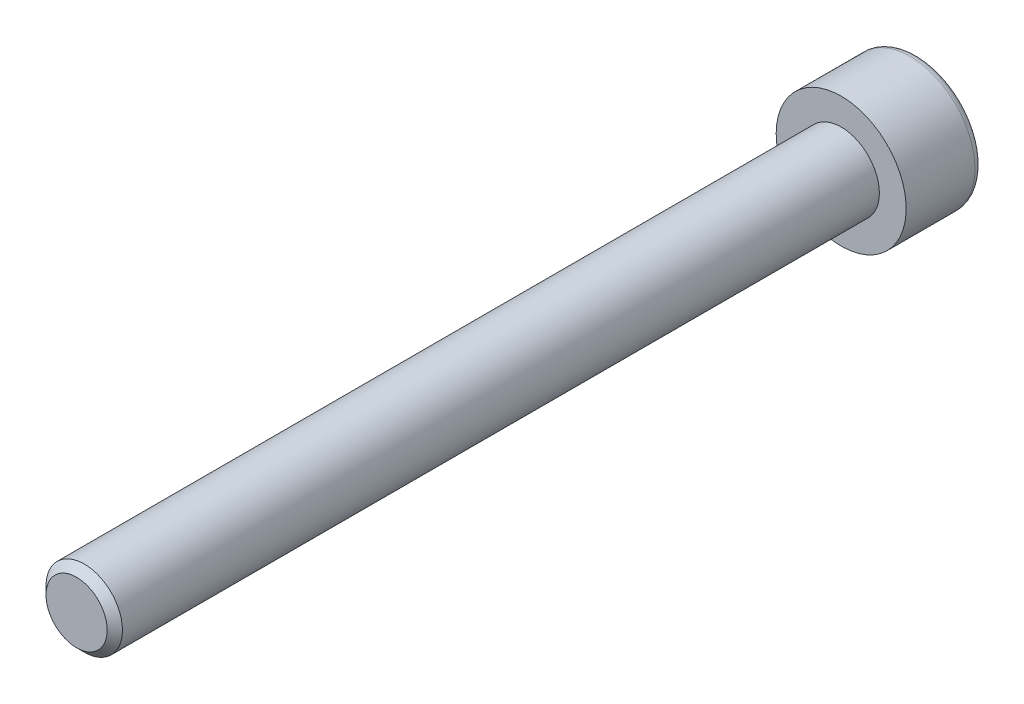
ISO-10303-21;
HEADER;
FILE_DESCRIPTION(('STEP AP214'),'2;1');
FILE_NAME('part.step','',(''),(''),'','','');
FILE_SCHEMA(('AUTOMOTIVE_DESIGN { 1 0 10303 214 1 1 1 1 }'));
ENDSEC;
DATA;
#1=APPLICATION_CONTEXT('core data for automotive mechanical design processes');
#2=APPLICATION_PROTOCOL_DEFINITION('international standard','automotive_design',2000,#1);
#3=PRODUCT_CONTEXT('',#1,'mechanical');
#4=PRODUCT('Part','Part','',(#3));
#5=PRODUCT_RELATED_PRODUCT_CATEGORY('part','',(#4));
#6=PRODUCT_DEFINITION_FORMATION('','',#4);
#7=PRODUCT_DEFINITION_CONTEXT('part definition',#1,'design');
#8=PRODUCT_DEFINITION('design','',#6,#7);
#9=PRODUCT_DEFINITION_SHAPE('','',#8);
#10=(LENGTH_UNIT() NAMED_UNIT(*) SI_UNIT(.MILLI.,.METRE.));
#11=(NAMED_UNIT(*) PLANE_ANGLE_UNIT() SI_UNIT($,.RADIAN.));
#12=(NAMED_UNIT(*) SI_UNIT($,.STERADIAN.) SOLID_ANGLE_UNIT());
#13=UNCERTAINTY_MEASURE_WITH_UNIT(LENGTH_MEASURE(1.E-05),#10,'distance_accuracy_value','');
#14=(GEOMETRIC_REPRESENTATION_CONTEXT(3) GLOBAL_UNCERTAINTY_ASSIGNED_CONTEXT((#13)) GLOBAL_UNIT_ASSIGNED_CONTEXT((#10,
#11,#12)) REPRESENTATION_CONTEXT('',''));
#15=CARTESIAN_POINT('',(0.,0.,0.));
#16=DIRECTION('',(0.,0.,1.));
#17=DIRECTION('',(1.,0.,0.));
#18=AXIS2_PLACEMENT_3D('',#15,#16,#17);
#19=CARTESIAN_POINT('',(0.,0.,-5.));
#20=DIRECTION('',(0.,0.,1.));
#21=DIRECTION('',(1.,0.,0.));
#22=AXIS2_PLACEMENT_3D('',#19,#20,#21);
#23=PLANE('',#22);
#24=CARTESIAN_POINT('',(0.,0.,-5.));
#25=DIRECTION('',(0.,0.,-1.));
#26=DIRECTION('',(-1.,0.,0.));
#27=AXIS2_PLACEMENT_3D('',#24,#25,#26);
#28=CIRCLE('',#27,3.75);
#29=CARTESIAN_POINT('',(-3.75,0.,-5.));
#30=VERTEX_POINT('',#29);
#31=EDGE_CURVE('E138',#30,#30,#28,.T.);
#32=ORIENTED_EDGE('',*,*,#31,.T.);
#33=EDGE_LOOP('',(#32));
#34=FACE_BOUND('',#33,.T.);
#35=DIRECTION('',(-0.86602540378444,0.499999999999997,0.));
#36=VECTOR('',#35,1.);
#37=CARTESIAN_POINT('',(0.,2.3094010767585,-5.));
#38=LINE('',#37,#36);
#39=CARTESIAN_POINT('',(2.,1.15470053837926,-5.));
#40=VERTEX_POINT('',#39);
#41=CARTESIAN_POINT('',(0.,2.3094010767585,-5.));
#42=VERTEX_POINT('',#41);
#43=EDGE_CURVE('E42',#40,#42,#38,.T.);
#44=ORIENTED_EDGE('',*,*,#43,.T.);
#45=DIRECTION('',(-0.866025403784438,-0.500000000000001,0.));
#46=VECTOR('',#45,1.);
#47=CARTESIAN_POINT('',(0.,2.3094010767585,-5.));
#48=LINE('',#47,#46);
#49=CARTESIAN_POINT('',(-2.,1.15470053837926,-5.));
#50=VERTEX_POINT('',#49);
#51=EDGE_CURVE('E82',#42,#50,#48,.T.);
#52=ORIENTED_EDGE('',*,*,#51,.T.);
#53=DIRECTION('',(0.,-1.,0.));
#54=VECTOR('',#53,1.);
#55=CARTESIAN_POINT('',(-2.,-1.15470053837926,-5.));
#56=LINE('',#55,#54);
#57=CARTESIAN_POINT('',(-2.,-1.15470053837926,-5.));
#58=VERTEX_POINT('',#57);
#59=EDGE_CURVE('E90',#50,#58,#56,.T.);
#60=ORIENTED_EDGE('',*,*,#59,.T.);
#61=DIRECTION('',(0.866025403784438,-0.500000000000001,0.));
#62=VECTOR('',#61,1.);
#63=CARTESIAN_POINT('',(0.,-2.3094010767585,-5.));
#64=LINE('',#63,#62);
#65=CARTESIAN_POINT('',(0.,-2.3094010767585,-5.));
#66=VERTEX_POINT('',#65);
#67=EDGE_CURVE('E108',#58,#66,#64,.T.);
#68=ORIENTED_EDGE('',*,*,#67,.T.);
#69=DIRECTION('',(0.86602540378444,0.499999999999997,0.));
#70=VECTOR('',#69,1.);
#71=CARTESIAN_POINT('',(0.,-2.3094010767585,-5.));
#72=LINE('',#71,#70);
#73=CARTESIAN_POINT('',(2.,-1.15470053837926,-5.));
#74=VERTEX_POINT('',#73);
#75=EDGE_CURVE('E111',#66,#74,#72,.T.);
#76=ORIENTED_EDGE('',*,*,#75,.T.);
#77=DIRECTION('',(0.,1.,0.));
#78=VECTOR('',#77,1.);
#79=CARTESIAN_POINT('',(2.,-1.15470053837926,-5.));
#80=LINE('',#79,#78);
#81=EDGE_CURVE('E101',#74,#40,#80,.T.);
#82=ORIENTED_EDGE('',*,*,#81,.T.);
#83=EDGE_LOOP('',(#44,#52,#60,#68,#76,#82));
#84=FACE_BOUND('',#83,.T.);
#85=ADVANCED_FACE('F28',(#34,#84),#23,.F.);
#86=CARTESIAN_POINT('',(0.,0.,-4.5));
#87=DIRECTION('',(0.,0.,-1.));
#88=DIRECTION('',(-1.,0.,0.));
#89=AXIS2_PLACEMENT_3D('',#86,#87,#88);
#90=TOROIDAL_SURFACE('',#89,3.75,0.5);
#91=ORIENTED_EDGE('',*,*,#31,.F.);
#92=EDGE_LOOP('',(#91));
#93=FACE_BOUND('',#92,.T.);
#94=CARTESIAN_POINT('',(0.,0.,-4.5));
#95=DIRECTION('',(0.,0.,-1.));
#96=DIRECTION('',(-1.,0.,0.));
#97=AXIS2_PLACEMENT_3D('',#94,#95,#96);
#98=CIRCLE('',#97,4.25);
#99=CARTESIAN_POINT('',(-4.25,0.,-4.5));
#100=VERTEX_POINT('',#99);
#101=EDGE_CURVE('E135',#100,#100,#98,.T.);
#102=ORIENTED_EDGE('',*,*,#101,.T.);
#103=EDGE_LOOP('',(#102));
#104=FACE_BOUND('',#103,.T.);
#105=ADVANCED_FACE('F157',(#93,#104),#90,.T.);
#106=CARTESIAN_POINT('',(0.,0.,0.));
#107=DIRECTION('',(0.,0.,-1.));
#108=DIRECTION('',(-1.,0.,0.));
#109=AXIS2_PLACEMENT_3D('',#106,#107,#108);
#110=CYLINDRICAL_SURFACE('',#109,4.25);
#111=ORIENTED_EDGE('',*,*,#101,.F.);
#112=EDGE_LOOP('',(#111));
#113=FACE_BOUND('',#112,.T.);
#114=CARTESIAN_POINT('',(0.,0.,0.));
#115=DIRECTION('',(0.,0.,-1.));
#116=DIRECTION('',(-1.,0.,0.));
#117=AXIS2_PLACEMENT_3D('',#114,#115,#116);
#118=CIRCLE('',#117,4.25);
#119=CARTESIAN_POINT('',(-4.25,0.,0.));
#120=VERTEX_POINT('',#119);
#121=EDGE_CURVE('E96',#120,#120,#118,.T.);
#122=ORIENTED_EDGE('',*,*,#121,.T.);
#123=EDGE_LOOP('',(#122));
#124=FACE_BOUND('',#123,.T.);
#125=ADVANCED_FACE('F162',(#113,#124),#110,.T.);
#126=CARTESIAN_POINT('',(0.,0.,0.));
#127=DIRECTION('',(0.,0.,-1.));
#128=DIRECTION('',(-1.,0.,0.));
#129=AXIS2_PLACEMENT_3D('',#126,#127,#128);
#130=PLANE('',#129);
#131=CARTESIAN_POINT('',(0.,0.,0.));
#132=DIRECTION('',(0.,0.,1.));
#133=DIRECTION('',(1.,0.,0.));
#134=AXIS2_PLACEMENT_3D('',#131,#132,#133);
#135=CIRCLE('',#134,2.5);
#136=CARTESIAN_POINT('',(2.5,0.,0.));
#137=VERTEX_POINT('',#136);
#138=EDGE_CURVE('E102',#137,#137,#135,.T.);
#139=ORIENTED_EDGE('',*,*,#138,.F.);
#140=EDGE_LOOP('',(#139));
#141=FACE_BOUND('',#140,.T.);
#142=ORIENTED_EDGE('',*,*,#121,.F.);
#143=EDGE_LOOP('',(#142));
#144=FACE_BOUND('',#143,.T.);
#145=ADVANCED_FACE('F170',(#141,#144),#130,.F.);
#146=CARTESIAN_POINT('',(0.,2.3094010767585,-2.5));
#147=DIRECTION('',(-0.499999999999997,-0.86602540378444,0.));
#148=DIRECTION('',(0.86602540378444,-0.499999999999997,0.));
#149=AXIS2_PLACEMENT_3D('',#146,#147,#148);
#150=PLANE('',#149);
#151=ORIENTED_EDGE('',*,*,#43,.F.);
#152=DIRECTION('',(0.,0.,-1.));
#153=VECTOR('',#152,1.);
#154=CARTESIAN_POINT('',(2.,1.15470053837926,-2.5));
#155=LINE('',#154,#153);
#156=CARTESIAN_POINT('',(2.,1.15470053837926,-2.5));
#157=VERTEX_POINT('',#156);
#158=EDGE_CURVE('E124',#157,#40,#155,.T.);
#159=ORIENTED_EDGE('',*,*,#158,.F.);
#160=DIRECTION('',(-0.86602540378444,0.499999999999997,0.));
#161=VECTOR('',#160,1.);
#162=CARTESIAN_POINT('',(0.,2.3094010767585,-2.5));
#163=LINE('',#162,#161);
#164=CARTESIAN_POINT('',(0.,2.3094010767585,-2.5));
#165=VERTEX_POINT('',#164);
#166=EDGE_CURVE('E95',#157,#165,#163,.T.);
#167=ORIENTED_EDGE('',*,*,#166,.T.);
#168=DIRECTION('',(0.,0.,-1.));
#169=VECTOR('',#168,1.);
#170=CARTESIAN_POINT('',(0.,2.3094010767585,-2.5));
#171=LINE('',#170,#169);
#172=EDGE_CURVE('E84',#165,#42,#171,.T.);
#173=ORIENTED_EDGE('',*,*,#172,.T.);
#174=EDGE_LOOP('',(#151,#159,#167,#173));
#175=FACE_BOUND('',#174,.T.);
#176=ADVANCED_FACE('F93',(#175),#150,.T.);
#177=CARTESIAN_POINT('',(0.,2.3094010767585,-2.5));
#178=DIRECTION('',(0.500000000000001,-0.866025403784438,0.));
#179=DIRECTION('',(0.866025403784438,0.500000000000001,0.));
#180=AXIS2_PLACEMENT_3D('',#177,#178,#179);
#181=PLANE('',#180);
#182=ORIENTED_EDGE('',*,*,#51,.F.);
#183=ORIENTED_EDGE('',*,*,#172,.F.);
#184=DIRECTION('',(-0.866025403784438,-0.500000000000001,0.));
#185=VECTOR('',#184,1.);
#186=CARTESIAN_POINT('',(0.,2.3094010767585,-2.5));
#187=LINE('',#186,#185);
#188=CARTESIAN_POINT('',(-2.,1.15470053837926,-2.5));
#189=VERTEX_POINT('',#188);
#190=EDGE_CURVE('E115',#165,#189,#187,.T.);
#191=ORIENTED_EDGE('',*,*,#190,.T.);
#192=DIRECTION('',(0.,0.,-1.));
#193=VECTOR('',#192,1.);
#194=CARTESIAN_POINT('',(-2.,1.15470053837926,-2.5));
#195=LINE('',#194,#193);
#196=EDGE_CURVE('E86',#189,#50,#195,.T.);
#197=ORIENTED_EDGE('',*,*,#196,.T.);
#198=EDGE_LOOP('',(#182,#183,#191,#197));
#199=FACE_BOUND('',#198,.T.);
#200=ADVANCED_FACE('F83',(#199),#181,.T.);
#201=CARTESIAN_POINT('',(-2.,-1.15470053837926,-2.5));
#202=DIRECTION('',(1.,0.,0.));
#203=DIRECTION('',(0.,0.,-1.));
#204=AXIS2_PLACEMENT_3D('',#201,#202,#203);
#205=PLANE('',#204);
#206=ORIENTED_EDGE('',*,*,#59,.F.);
#207=ORIENTED_EDGE('',*,*,#196,.F.);
#208=DIRECTION('',(0.,-1.,0.));
#209=VECTOR('',#208,1.);
#210=CARTESIAN_POINT('',(-2.,-1.15470053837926,-2.5));
#211=LINE('',#210,#209);
#212=CARTESIAN_POINT('',(-2.,-1.15470053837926,-2.5));
#213=VERTEX_POINT('',#212);
#214=EDGE_CURVE('E117',#189,#213,#211,.T.);
#215=ORIENTED_EDGE('',*,*,#214,.T.);
#216=DIRECTION('',(0.,0.,-1.));
#217=VECTOR('',#216,1.);
#218=CARTESIAN_POINT('',(-2.,-1.15470053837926,-2.5));
#219=LINE('',#218,#217);
#220=EDGE_CURVE('E130',#213,#58,#219,.T.);
#221=ORIENTED_EDGE('',*,*,#220,.T.);
#222=EDGE_LOOP('',(#206,#207,#215,#221));
#223=FACE_BOUND('',#222,.T.);
#224=ADVANCED_FACE('F185',(#223),#205,.T.);
#225=CARTESIAN_POINT('',(0.,-2.3094010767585,-2.5));
#226=DIRECTION('',(0.500000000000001,0.866025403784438,0.));
#227=DIRECTION('',(-0.866025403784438,0.500000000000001,0.));
#228=AXIS2_PLACEMENT_3D('',#225,#226,#227);
#229=PLANE('',#228);
#230=ORIENTED_EDGE('',*,*,#67,.F.);
#231=ORIENTED_EDGE('',*,*,#220,.F.);
#232=DIRECTION('',(0.866025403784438,-0.500000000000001,0.));
#233=VECTOR('',#232,1.);
#234=CARTESIAN_POINT('',(0.,-2.3094010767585,-2.5));
#235=LINE('',#234,#233);
#236=CARTESIAN_POINT('',(0.,-2.3094010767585,-2.5));
#237=VERTEX_POINT('',#236);
#238=EDGE_CURVE('E119',#213,#237,#235,.T.);
#239=ORIENTED_EDGE('',*,*,#238,.T.);
#240=DIRECTION('',(0.,0.,-1.));
#241=VECTOR('',#240,1.);
#242=CARTESIAN_POINT('',(0.,-2.3094010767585,-2.5));
#243=LINE('',#242,#241);
#244=EDGE_CURVE('E128',#237,#66,#243,.T.);
#245=ORIENTED_EDGE('',*,*,#244,.T.);
#246=EDGE_LOOP('',(#230,#231,#239,#245));
#247=FACE_BOUND('',#246,.T.);
#248=ADVANCED_FACE('F188',(#247),#229,.T.);
#249=CARTESIAN_POINT('',(0.,-2.3094010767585,-2.5));
#250=DIRECTION('',(-0.499999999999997,0.86602540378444,0.));
#251=DIRECTION('',(-0.86602540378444,-0.499999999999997,0.));
#252=AXIS2_PLACEMENT_3D('',#249,#250,#251);
#253=PLANE('',#252);
#254=ORIENTED_EDGE('',*,*,#75,.F.);
#255=ORIENTED_EDGE('',*,*,#244,.F.);
#256=DIRECTION('',(0.86602540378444,0.499999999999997,0.));
#257=VECTOR('',#256,1.);
#258=CARTESIAN_POINT('',(0.,-2.3094010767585,-2.5));
#259=LINE('',#258,#257);
#260=CARTESIAN_POINT('',(2.,-1.15470053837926,-2.5));
#261=VERTEX_POINT('',#260);
#262=EDGE_CURVE('E121',#237,#261,#259,.T.);
#263=ORIENTED_EDGE('',*,*,#262,.T.);
#264=DIRECTION('',(0.,0.,-1.));
#265=VECTOR('',#264,1.);
#266=CARTESIAN_POINT('',(2.,-1.15470053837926,-2.5));
#267=LINE('',#266,#265);
#268=EDGE_CURVE('E126',#261,#74,#267,.T.);
#269=ORIENTED_EDGE('',*,*,#268,.T.);
#270=EDGE_LOOP('',(#254,#255,#263,#269));
#271=FACE_BOUND('',#270,.T.);
#272=ADVANCED_FACE('F192',(#271),#253,.T.);
#273=CARTESIAN_POINT('',(2.,-1.15470053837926,-2.5));
#274=DIRECTION('',(-1.,0.,0.));
#275=DIRECTION('',(0.,0.,1.));
#276=AXIS2_PLACEMENT_3D('',#273,#274,#275);
#277=PLANE('',#276);
#278=ORIENTED_EDGE('',*,*,#81,.F.);
#279=ORIENTED_EDGE('',*,*,#268,.F.);
#280=DIRECTION('',(0.,1.,0.));
#281=VECTOR('',#280,1.);
#282=CARTESIAN_POINT('',(2.,-1.15470053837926,-2.5));
#283=LINE('',#282,#281);
#284=EDGE_CURVE('E49',#261,#157,#283,.T.);
#285=ORIENTED_EDGE('',*,*,#284,.T.);
#286=ORIENTED_EDGE('',*,*,#158,.T.);
#287=EDGE_LOOP('',(#278,#279,#285,#286));
#288=FACE_BOUND('',#287,.T.);
#289=ADVANCED_FACE('F196',(#288),#277,.T.);
#290=CARTESIAN_POINT('',(2.,1.15470053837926,-2.5));
#291=DIRECTION('',(0.,0.,1.));
#292=DIRECTION('',(1.,0.,0.));
#293=AXIS2_PLACEMENT_3D('',#290,#291,#292);
#294=PLANE('',#293);
#295=ORIENTED_EDGE('',*,*,#166,.F.);
#296=ORIENTED_EDGE('',*,*,#284,.F.);
#297=ORIENTED_EDGE('',*,*,#262,.F.);
#298=ORIENTED_EDGE('',*,*,#238,.F.);
#299=ORIENTED_EDGE('',*,*,#214,.F.);
#300=ORIENTED_EDGE('',*,*,#190,.F.);
#301=EDGE_LOOP('',(#295,#296,#297,#298,#299,#300));
#302=FACE_BOUND('',#301,.T.);
#303=ADVANCED_FACE('F200',(#302),#294,.F.);
#304=CARTESIAN_POINT('',(0.,0.,50.));
#305=DIRECTION('',(0.,0.,1.));
#306=DIRECTION('',(1.,0.,0.));
#307=AXIS2_PLACEMENT_3D('',#304,#305,#306);
#308=PLANE('',#307);
#309=CARTESIAN_POINT('',(0.,0.,50.));
#310=DIRECTION('',(0.,0.,1.));
#311=DIRECTION('',(1.,0.,0.));
#312=AXIS2_PLACEMENT_3D('',#309,#310,#311);
#313=CIRCLE('',#312,1.99999999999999);
#314=CARTESIAN_POINT('',(2.,0.,50.));
#315=VERTEX_POINT('',#314);
#316=EDGE_CURVE('E35',#315,#315,#313,.T.);
#317=ORIENTED_EDGE('',*,*,#316,.T.);
#318=EDGE_LOOP('',(#317));
#319=FACE_BOUND('',#318,.T.);
#320=ADVANCED_FACE('F143',(#319),#308,.T.);
#321=CARTESIAN_POINT('',(0.,0.,0.));
#322=DIRECTION('',(0.,0.,1.));
#323=DIRECTION('',(1.,0.,0.));
#324=AXIS2_PLACEMENT_3D('',#321,#322,#323);
#325=CYLINDRICAL_SURFACE('',#324,2.5);
#326=CARTESIAN_POINT('',(0.,0.,49.5));
#327=DIRECTION('',(0.,0.,1.));
#328=DIRECTION('',(1.,0.,0.));
#329=AXIS2_PLACEMENT_3D('',#326,#327,#328);
#330=CIRCLE('',#329,2.5);
#331=CARTESIAN_POINT('',(2.50000000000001,0.,49.5));
#332=VERTEX_POINT('',#331);
#333=EDGE_CURVE('E11',#332,#332,#330,.F.);
#334=ORIENTED_EDGE('',*,*,#333,.T.);
#335=EDGE_LOOP('',(#334));
#336=FACE_BOUND('',#335,.T.);
#337=ORIENTED_EDGE('',*,*,#138,.T.);
#338=EDGE_LOOP('',(#337));
#339=FACE_BOUND('',#338,.T.);
#340=ADVANCED_FACE('F147',(#336,#339),#325,.T.);
#341=CARTESIAN_POINT('',(0.,0.,50.));
#342=DIRECTION('',(0.,0.,-1.));
#343=DIRECTION('',(-1.,0.,0.));
#344=AXIS2_PLACEMENT_3D('',#341,#342,#343);
#345=CONICAL_SURFACE('',#344,1.99999999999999,0.785398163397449);
#346=ORIENTED_EDGE('',*,*,#333,.F.);
#347=EDGE_LOOP('',(#346));
#348=FACE_BOUND('',#347,.T.);
#349=ORIENTED_EDGE('',*,*,#316,.F.);
#350=EDGE_LOOP('',(#349));
#351=FACE_BOUND('',#350,.T.);
#352=ADVANCED_FACE('F145',(#348,#351),#345,.T.);
#353=CLOSED_SHELL('',(#85,#105,#125,#145,#176,#200,#224,#248,#272,#289,#303,#320,#340,#352));
#354=MANIFOLD_SOLID_BREP('B2',#353);
#355=ADVANCED_BREP_SHAPE_REPRESENTATION('',(#18,#354),#14);
#356=SHAPE_DEFINITION_REPRESENTATION(#9,#355);
ENDSEC;
END-ISO-10303-21;
